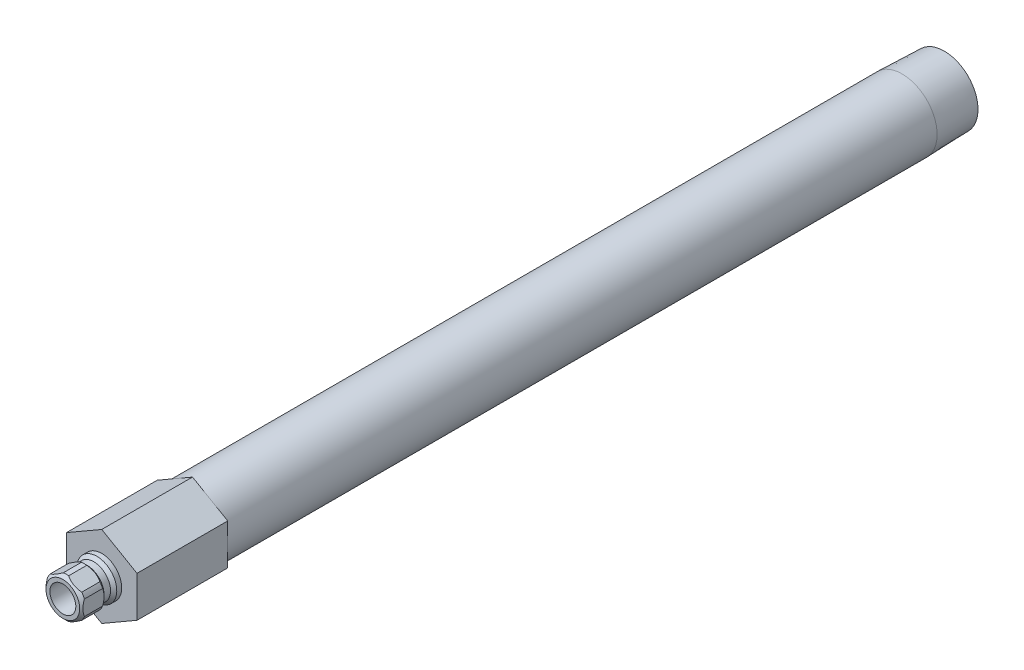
ISO-10303-21;
HEADER;
FILE_DESCRIPTION(('STEP AP214'),'2;1');
FILE_NAME('part.step','',(''),(''),'','','');
FILE_SCHEMA(('AUTOMOTIVE_DESIGN { 1 0 10303 214 1 1 1 1 }'));
ENDSEC;
DATA;
#1=APPLICATION_CONTEXT('core data for automotive mechanical design processes');
#2=APPLICATION_PROTOCOL_DEFINITION('international standard','automotive_design',2000,#1);
#3=PRODUCT_CONTEXT('',#1,'mechanical');
#4=PRODUCT('Part','Part','',(#3));
#5=PRODUCT_RELATED_PRODUCT_CATEGORY('part','',(#4));
#6=PRODUCT_DEFINITION_FORMATION('','',#4);
#7=PRODUCT_DEFINITION_CONTEXT('part definition',#1,'design');
#8=PRODUCT_DEFINITION('design','',#6,#7);
#9=PRODUCT_DEFINITION_SHAPE('','',#8);
#10=(LENGTH_UNIT() NAMED_UNIT(*) SI_UNIT(.MILLI.,.METRE.));
#11=(NAMED_UNIT(*) PLANE_ANGLE_UNIT() SI_UNIT($,.RADIAN.));
#12=(NAMED_UNIT(*) SI_UNIT($,.STERADIAN.) SOLID_ANGLE_UNIT());
#13=UNCERTAINTY_MEASURE_WITH_UNIT(LENGTH_MEASURE(1.E-05),#10,'distance_accuracy_value','');
#14=(GEOMETRIC_REPRESENTATION_CONTEXT(3) GLOBAL_UNCERTAINTY_ASSIGNED_CONTEXT((#13)) GLOBAL_UNIT_ASSIGNED_CONTEXT((#10,
#11,#12)) REPRESENTATION_CONTEXT('',''));
#15=CARTESIAN_POINT('',(0.,0.,0.));
#16=DIRECTION('',(0.,0.,1.));
#17=DIRECTION('',(1.,0.,0.));
#18=AXIS2_PLACEMENT_3D('',#15,#16,#17);
#19=CARTESIAN_POINT('',(0.,0.,0.));
#20=DIRECTION('',(0.,0.,-1.));
#21=DIRECTION('',(0.,1.,0.));
#22=AXIS2_PLACEMENT_3D('',#19,#20,#21);
#23=CYLINDRICAL_SURFACE('',#22,4.8895);
#24=DIRECTION('',(0.,0.,-1.));
#25=VECTOR('',#24,1.);
#26=CARTESIAN_POINT('',(4.5212,1.86170910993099,0.));
#27=LINE('',#26,#25);
#28=CARTESIAN_POINT('',(4.5212,1.86170910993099,4.318));
#29=VERTEX_POINT('',#28);
#30=CARTESIAN_POINT('',(4.5212,1.86170910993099,8.763));
#31=VERTEX_POINT('',#30);
#32=EDGE_CURVE('E404',#29,#31,#27,.F.);
#33=ORIENTED_EDGE('',*,*,#32,.F.);
#34=CARTESIAN_POINT('',(0.,0.,4.318));
#35=DIRECTION('',(0.,0.,-1.));
#36=DIRECTION('',(0.,1.,0.));
#37=AXIS2_PLACEMENT_3D('',#34,#35,#36);
#38=CIRCLE('',#37,4.8895);
#39=CARTESIAN_POINT('',(3.87288738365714,2.98461950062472,4.318));
#40=VERTEX_POINT('',#39);
#41=EDGE_CURVE('E206',#40,#29,#38,.T.);
#42=ORIENTED_EDGE('',*,*,#41,.F.);
#43=DIRECTION('',(0.,0.,-1.));
#44=VECTOR('',#43,1.);
#45=CARTESIAN_POINT('',(3.87288738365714,2.98461950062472,0.));
#46=LINE('',#45,#44);
#47=CARTESIAN_POINT('',(3.87288738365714,2.98461950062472,8.763));
#48=VERTEX_POINT('',#47);
#49=EDGE_CURVE('E392',#48,#40,#46,.T.);
#50=ORIENTED_EDGE('',*,*,#49,.F.);
#51=CARTESIAN_POINT('',(0.,0.,8.763));
#52=DIRECTION('',(0.,0.,-1.));
#53=DIRECTION('',(0.,1.,0.));
#54=AXIS2_PLACEMENT_3D('',#51,#52,#53);
#55=CIRCLE('',#54,4.8895);
#56=EDGE_CURVE('E193',#48,#31,#55,.T.);
#57=ORIENTED_EDGE('',*,*,#56,.T.);
#58=EDGE_LOOP('',(#33,#42,#50,#57));
#59=FACE_BOUND('',#58,.T.);
#60=ADVANCED_FACE('F34',(#59),#23,.T.);
#61=DIRECTION('',(0.,0.,-1.));
#62=VECTOR('',#61,1.);
#63=CARTESIAN_POINT('',(0.648312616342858,4.84632861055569,0.));
#64=LINE('',#63,#62);
#65=CARTESIAN_POINT('',(0.648312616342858,4.84632861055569,4.318));
#66=VERTEX_POINT('',#65);
#67=CARTESIAN_POINT('',(0.648312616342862,4.84632861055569,8.763));
#68=VERTEX_POINT('',#67);
#69=EDGE_CURVE('E311',#66,#68,#64,.F.);
#70=ORIENTED_EDGE('',*,*,#69,.F.);
#71=CARTESIAN_POINT('',(-0.648312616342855,4.84632861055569,4.318));
#72=VERTEX_POINT('',#71);
#73=EDGE_CURVE('E202',#72,#66,#38,.T.);
#74=ORIENTED_EDGE('',*,*,#73,.F.);
#75=DIRECTION('',(0.,0.,-1.));
#76=VECTOR('',#75,1.);
#77=CARTESIAN_POINT('',(-0.648312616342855,4.84632861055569,0.));
#78=LINE('',#77,#76);
#79=CARTESIAN_POINT('',(-0.648312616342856,4.84632861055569,8.763));
#80=VERTEX_POINT('',#79);
#81=EDGE_CURVE('E391',#80,#72,#78,.T.);
#82=ORIENTED_EDGE('',*,*,#81,.F.);
#83=EDGE_CURVE('E196',#80,#68,#55,.T.);
#84=ORIENTED_EDGE('',*,*,#83,.T.);
#85=EDGE_LOOP('',(#70,#74,#82,#84));
#86=FACE_BOUND('',#85,.T.);
#87=ADVANCED_FACE('F345',(#86),#23,.T.);
#88=DIRECTION('',(0.,0.,-1.));
#89=VECTOR('',#88,1.);
#90=CARTESIAN_POINT('',(-3.87288738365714,2.98461950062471,0.));
#91=LINE('',#90,#89);
#92=CARTESIAN_POINT('',(-3.87288738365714,2.98461950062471,4.318));
#93=VERTEX_POINT('',#92);
#94=CARTESIAN_POINT('',(-3.87288738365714,2.98461950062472,8.763));
#95=VERTEX_POINT('',#94);
#96=EDGE_CURVE('E54',#93,#95,#91,.F.);
#97=ORIENTED_EDGE('',*,*,#96,.F.);
#98=CARTESIAN_POINT('',(-4.5212,1.86170910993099,4.318));
#99=VERTEX_POINT('',#98);
#100=EDGE_CURVE('E205',#99,#93,#38,.T.);
#101=ORIENTED_EDGE('',*,*,#100,.F.);
#102=DIRECTION('',(0.,0.,-1.));
#103=VECTOR('',#102,1.);
#104=CARTESIAN_POINT('',(-4.5212,1.86170910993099,0.));
#105=LINE('',#104,#103);
#106=CARTESIAN_POINT('',(-4.5212,1.86170910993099,8.763));
#107=VERTEX_POINT('',#106);
#108=EDGE_CURVE('E378',#107,#99,#105,.T.);
#109=ORIENTED_EDGE('',*,*,#108,.F.);
#110=EDGE_CURVE('E195',#107,#95,#55,.T.);
#111=ORIENTED_EDGE('',*,*,#110,.T.);
#112=EDGE_LOOP('',(#97,#101,#109,#111));
#113=FACE_BOUND('',#112,.T.);
#114=ADVANCED_FACE('F350',(#113),#23,.T.);
#115=DIRECTION('',(0.,0.,-1.));
#116=VECTOR('',#115,1.);
#117=CARTESIAN_POINT('',(-4.5212,-1.86170910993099,0.));
#118=LINE('',#117,#116);
#119=CARTESIAN_POINT('',(-4.5212,-1.86170910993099,4.318));
#120=VERTEX_POINT('',#119);
#121=CARTESIAN_POINT('',(-4.5212,-1.86170910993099,8.763));
#122=VERTEX_POINT('',#121);
#123=EDGE_CURVE('E62',#120,#122,#118,.F.);
#124=ORIENTED_EDGE('',*,*,#123,.F.);
#125=CARTESIAN_POINT('',(-3.87288738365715,-2.98461950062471,4.318));
#126=VERTEX_POINT('',#125);
#127=EDGE_CURVE('E377',#126,#120,#38,.T.);
#128=ORIENTED_EDGE('',*,*,#127,.F.);
#129=DIRECTION('',(0.,0.,-1.));
#130=VECTOR('',#129,1.);
#131=CARTESIAN_POINT('',(-3.87288738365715,-2.98461950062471,0.));
#132=LINE('',#131,#130);
#133=CARTESIAN_POINT('',(-3.87288738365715,-2.98461950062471,8.763));
#134=VERTEX_POINT('',#133);
#135=EDGE_CURVE('E265',#134,#126,#132,.T.);
#136=ORIENTED_EDGE('',*,*,#135,.F.);
#137=EDGE_CURVE('E191',#134,#122,#55,.T.);
#138=ORIENTED_EDGE('',*,*,#137,.T.);
#139=EDGE_LOOP('',(#124,#128,#136,#138));
#140=FACE_BOUND('',#139,.T.);
#141=ADVANCED_FACE('F362',(#140),#23,.T.);
#142=DIRECTION('',(0.,0.,-1.));
#143=VECTOR('',#142,1.);
#144=CARTESIAN_POINT('',(-0.648312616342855,-4.84632861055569,0.));
#145=LINE('',#144,#143);
#146=CARTESIAN_POINT('',(-0.648312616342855,-4.84632861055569,4.318));
#147=VERTEX_POINT('',#146);
#148=CARTESIAN_POINT('',(-0.648312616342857,-4.84632861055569,8.763));
#149=VERTEX_POINT('',#148);
#150=EDGE_CURVE('E394',#147,#149,#145,.F.);
#151=ORIENTED_EDGE('',*,*,#150,.F.);
#152=CARTESIAN_POINT('',(0.648312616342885,-4.84632861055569,4.318));
#153=VERTEX_POINT('',#152);
#154=EDGE_CURVE('E183',#153,#147,#38,.T.);
#155=ORIENTED_EDGE('',*,*,#154,.F.);
#156=DIRECTION('',(0.,0.,-1.));
#157=VECTOR('',#156,1.);
#158=CARTESIAN_POINT('',(0.648312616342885,-4.84632861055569,0.));
#159=LINE('',#158,#157);
#160=CARTESIAN_POINT('',(0.648312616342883,-4.84632861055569,8.763));
#161=VERTEX_POINT('',#160);
#162=EDGE_CURVE('E165',#161,#153,#159,.T.);
#163=ORIENTED_EDGE('',*,*,#162,.F.);
#164=EDGE_CURVE('E181',#161,#149,#55,.T.);
#165=ORIENTED_EDGE('',*,*,#164,.T.);
#166=EDGE_LOOP('',(#151,#155,#163,#165));
#167=FACE_BOUND('',#166,.T.);
#168=ADVANCED_FACE('F180',(#167),#23,.T.);
#169=CARTESIAN_POINT('',(0.,0.,0.));
#170=DIRECTION('',(0.,0.,-1.));
#171=DIRECTION('',(0.,1.,0.));
#172=AXIS2_PLACEMENT_3D('',#169,#170,#171);
#173=CYLINDRICAL_SURFACE('',#172,8.57249999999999);
#174=CARTESIAN_POINT('',(0.,0.,-196.0372));
#175=DIRECTION('',(0.,0.,-1.));
#176=DIRECTION('',(0.,1.,0.));
#177=AXIS2_PLACEMENT_3D('',#174,#175,#176);
#178=CIRCLE('',#177,8.57249999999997);
#179=CARTESIAN_POINT('',(0.,8.5725,-196.0372));
#180=VERTEX_POINT('',#179);
#181=EDGE_CURVE('E219',#180,#180,#178,.T.);
#182=ORIENTED_EDGE('',*,*,#181,.F.);
#183=EDGE_LOOP('',(#182));
#184=FACE_BOUND('',#183,.T.);
#185=CARTESIAN_POINT('',(0.,0.,-22.225));
#186=DIRECTION('',(0.,0.,1.));
#187=DIRECTION('',(1.,0.,0.));
#188=AXIS2_PLACEMENT_3D('',#185,#186,#187);
#189=CIRCLE('',#188,8.57249999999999);
#190=CARTESIAN_POINT('',(8.57249999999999,0.,-22.225));
#191=VERTEX_POINT('',#190);
#192=EDGE_CURVE('E233',#191,#191,#189,.F.);
#193=ORIENTED_EDGE('',*,*,#192,.T.);
#194=EDGE_LOOP('',(#193));
#195=FACE_BOUND('',#194,.T.);
#196=ADVANCED_FACE('F361',(#184,#195),#173,.T.);
#197=CARTESIAN_POINT('',(0.,0.,0.));
#198=DIRECTION('',(0.,0.,-1.));
#199=DIRECTION('',(0.,1.,0.));
#200=AXIS2_PLACEMENT_3D('',#197,#198,#199);
#201=CYLINDRICAL_SURFACE('',#200,3.175);
#202=CARTESIAN_POINT('',(0.,0.,9.525));
#203=DIRECTION('',(0.,0.,-1.));
#204=DIRECTION('',(0.,1.,0.));
#205=AXIS2_PLACEMENT_3D('',#202,#203,#204);
#206=CIRCLE('',#205,3.175);
#207=CARTESIAN_POINT('',(0.,3.175,9.525));
#208=VERTEX_POINT('',#207);
#209=EDGE_CURVE('E235',#208,#208,#206,.T.);
#210=ORIENTED_EDGE('',*,*,#209,.F.);
#211=EDGE_LOOP('',(#210));
#212=FACE_BOUND('',#211,.T.);
#213=CARTESIAN_POINT('',(0.,0.,-22.225));
#214=DIRECTION('',(0.,0.,-1.));
#215=DIRECTION('',(0.,1.,0.));
#216=AXIS2_PLACEMENT_3D('',#213,#214,#215);
#217=CIRCLE('',#216,3.175);
#218=CARTESIAN_POINT('',(0.,3.175,-22.225));
#219=VERTEX_POINT('',#218);
#220=EDGE_CURVE('E174',#219,#219,#217,.T.);
#221=ORIENTED_EDGE('',*,*,#220,.T.);
#222=EDGE_LOOP('',(#221));
#223=FACE_BOUND('',#222,.T.);
#224=ADVANCED_FACE('F36',(#212,#223),#201,.F.);
#225=CARTESIAN_POINT('',(0.,3.175,-22.225));
#226=DIRECTION('',(0.,0.,-1.));
#227=DIRECTION('',(0.,1.,0.));
#228=AXIS2_PLACEMENT_3D('',#225,#226,#227);
#229=PLANE('',#228);
#230=CARTESIAN_POINT('',(0.,0.,-22.225));
#231=DIRECTION('',(0.,0.,-1.));
#232=DIRECTION('',(0.,1.,0.));
#233=AXIS2_PLACEMENT_3D('',#230,#231,#232);
#234=CIRCLE('',#233,6.2611);
#235=CARTESIAN_POINT('',(0.,6.2611,-22.225));
#236=VERTEX_POINT('',#235);
#237=EDGE_CURVE('E228',#236,#236,#234,.T.);
#238=ORIENTED_EDGE('',*,*,#237,.T.);
#239=EDGE_LOOP('',(#238));
#240=FACE_BOUND('',#239,.T.);
#241=ORIENTED_EDGE('',*,*,#220,.F.);
#242=EDGE_LOOP('',(#241));
#243=FACE_BOUND('',#242,.T.);
#244=ADVANCED_FACE('F533',(#240,#243),#229,.T.);
#245=CARTESIAN_POINT('',(0.,0.,0.));
#246=DIRECTION('',(0.,0.,-1.));
#247=DIRECTION('',(0.,1.,0.));
#248=AXIS2_PLACEMENT_3D('',#245,#246,#247);
#249=CYLINDRICAL_SURFACE('',#248,6.26109999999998);
#250=CARTESIAN_POINT('',(0.,0.,-206.375));
#251=DIRECTION('',(0.,0.,-1.));
#252=DIRECTION('',(0.,1.,0.));
#253=AXIS2_PLACEMENT_3D('',#250,#251,#252);
#254=CIRCLE('',#253,6.26109999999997);
#255=CARTESIAN_POINT('',(0.,6.2611,-206.375));
#256=VERTEX_POINT('',#255);
#257=EDGE_CURVE('E225',#256,#256,#254,.T.);
#258=ORIENTED_EDGE('',*,*,#257,.T.);
#259=EDGE_LOOP('',(#258));
#260=FACE_BOUND('',#259,.T.);
#261=ORIENTED_EDGE('',*,*,#237,.F.);
#262=EDGE_LOOP('',(#261));
#263=FACE_BOUND('',#262,.T.);
#264=ADVANCED_FACE('F530',(#260,#263),#249,.F.);
#265=CARTESIAN_POINT('',(0.,8.24944566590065,-206.375));
#266=DIRECTION('',(0.,0.,-1.));
#267=DIRECTION('',(0.,1.,0.));
#268=AXIS2_PLACEMENT_3D('',#265,#266,#267);
#269=PLANE('',#268);
#270=CARTESIAN_POINT('',(0.,0.,-206.375));
#271=DIRECTION('',(0.,0.,-1.));
#272=DIRECTION('',(0.,1.,0.));
#273=AXIS2_PLACEMENT_3D('',#270,#271,#272);
#274=CIRCLE('',#273,8.24944566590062);
#275=CARTESIAN_POINT('',(0.,8.24944566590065,-206.375));
#276=VERTEX_POINT('',#275);
#277=EDGE_CURVE('E222',#276,#276,#274,.T.);
#278=ORIENTED_EDGE('',*,*,#277,.T.);
#279=EDGE_LOOP('',(#278));
#280=FACE_BOUND('',#279,.T.);
#281=ORIENTED_EDGE('',*,*,#257,.F.);
#282=EDGE_LOOP('',(#281));
#283=FACE_BOUND('',#282,.T.);
#284=ADVANCED_FACE('F524',(#280,#283),#269,.T.);
#285=CARTESIAN_POINT('',(0.,0.,-206.375));
#286=DIRECTION('',(0.,0.,1.));
#287=DIRECTION('',(0.,-1.,0.));
#288=AXIS2_PLACEMENT_3D('',#285,#286,#287);
#289=CONICAL_SURFACE('',#288,8.24944566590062,0.0312396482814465);
#290=ORIENTED_EDGE('',*,*,#181,.T.);
#291=EDGE_LOOP('',(#290));
#292=FACE_BOUND('',#291,.T.);
#293=ORIENTED_EDGE('',*,*,#277,.F.);
#294=EDGE_LOOP('',(#293));
#295=FACE_BOUND('',#294,.T.);
#296=ADVANCED_FACE('F514',(#292,#295),#289,.T.);
#297=CARTESIAN_POINT('',(0.,4.8895,0.));
#298=DIRECTION('',(0.,0.,1.));
#299=DIRECTION('',(0.,-1.,0.));
#300=AXIS2_PLACEMENT_3D('',#297,#298,#299);
#301=PLANE('',#300);
#302=CARTESIAN_POINT('',(0.,0.,0.));
#303=DIRECTION('',(0.,0.,-1.));
#304=DIRECTION('',(0.,1.,0.));
#305=AXIS2_PLACEMENT_3D('',#302,#303,#304);
#306=CIRCLE('',#305,4.8895);
#307=CARTESIAN_POINT('',(0.,4.8895,0.));
#308=VERTEX_POINT('',#307);
#309=EDGE_CURVE('E216',#308,#308,#306,.T.);
#310=ORIENTED_EDGE('',*,*,#309,.T.);
#311=EDGE_LOOP('',(#310));
#312=FACE_BOUND('',#311,.T.);
#313=DIRECTION('',(-0.866025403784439,-0.5,0.));
#314=VECTOR('',#313,1.);
#315=CARTESIAN_POINT('',(0.,9.97199384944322,0.));
#316=LINE('',#315,#314);
#317=CARTESIAN_POINT('',(0.,9.97199384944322,0.));
#318=VERTEX_POINT('',#317);
#319=CARTESIAN_POINT('',(-8.636,4.98599692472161,0.));
#320=VERTEX_POINT('',#319);
#321=EDGE_CURVE('E409',#318,#320,#316,.T.);
#322=ORIENTED_EDGE('',*,*,#321,.T.);
#323=DIRECTION('',(0.,-1.,0.));
#324=VECTOR('',#323,1.);
#325=CARTESIAN_POINT('',(-8.636,4.98599692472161,0.));
#326=LINE('',#325,#324);
#327=CARTESIAN_POINT('',(-8.636,-4.98599692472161,0.));
#328=VERTEX_POINT('',#327);
#329=EDGE_CURVE('E436',#320,#328,#326,.T.);
#330=ORIENTED_EDGE('',*,*,#329,.T.);
#331=DIRECTION('',(0.866025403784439,-0.5,0.));
#332=VECTOR('',#331,1.);
#333=CARTESIAN_POINT('',(-8.636,-4.98599692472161,0.));
#334=LINE('',#333,#332);
#335=CARTESIAN_POINT('',(0.,-9.97199384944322,0.));
#336=VERTEX_POINT('',#335);
#337=EDGE_CURVE('E439',#328,#336,#334,.T.);
#338=ORIENTED_EDGE('',*,*,#337,.T.);
#339=DIRECTION('',(0.866025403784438,0.5,0.));
#340=VECTOR('',#339,1.);
#341=CARTESIAN_POINT('',(0.,-9.97199384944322,0.));
#342=LINE('',#341,#340);
#343=CARTESIAN_POINT('',(8.636,-4.98599692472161,0.));
#344=VERTEX_POINT('',#343);
#345=EDGE_CURVE('E442',#336,#344,#342,.T.);
#346=ORIENTED_EDGE('',*,*,#345,.T.);
#347=DIRECTION('',(0.,1.,0.));
#348=VECTOR('',#347,1.);
#349=CARTESIAN_POINT('',(8.636,-4.98599692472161,0.));
#350=LINE('',#349,#348);
#351=CARTESIAN_POINT('',(8.636,4.98599692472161,0.));
#352=VERTEX_POINT('',#351);
#353=EDGE_CURVE('E445',#344,#352,#350,.T.);
#354=ORIENTED_EDGE('',*,*,#353,.T.);
#355=DIRECTION('',(-0.866025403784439,0.5,0.));
#356=VECTOR('',#355,1.);
#357=CARTESIAN_POINT('',(8.636,4.98599692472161,0.));
#358=LINE('',#357,#356);
#359=EDGE_CURVE('E418',#352,#318,#358,.T.);
#360=ORIENTED_EDGE('',*,*,#359,.T.);
#361=EDGE_LOOP('',(#322,#330,#338,#346,#354,#360));
#362=FACE_BOUND('',#361,.T.);
#363=ADVANCED_FACE('F511',(#312,#362),#301,.T.);
#364=CARTESIAN_POINT('',(0.,0.,0.));
#365=DIRECTION('',(0.,0.,-1.));
#366=DIRECTION('',(0.,1.,0.));
#367=AXIS2_PLACEMENT_3D('',#364,#365,#366);
#368=CYLINDRICAL_SURFACE('',#367,4.8895);
#369=CARTESIAN_POINT('',(0.,0.,1.2065));
#370=DIRECTION('',(0.,0.,-1.));
#371=DIRECTION('',(0.,1.,0.));
#372=AXIS2_PLACEMENT_3D('',#369,#370,#371);
#373=CIRCLE('',#372,4.8895);
#374=CARTESIAN_POINT('',(0.,4.8895,1.2065));
#375=VERTEX_POINT('',#374);
#376=EDGE_CURVE('E213',#375,#375,#373,.T.);
#377=ORIENTED_EDGE('',*,*,#376,.T.);
#378=EDGE_LOOP('',(#377));
#379=FACE_BOUND('',#378,.T.);
#380=ORIENTED_EDGE('',*,*,#309,.F.);
#381=EDGE_LOOP('',(#380));
#382=FACE_BOUND('',#381,.T.);
#383=ADVANCED_FACE('F513',(#379,#382),#368,.T.);
#384=CARTESIAN_POINT('',(0.,0.,1.2065));
#385=DIRECTION('',(0.,0.,-1.));
#386=DIRECTION('',(0.,1.,0.));
#387=AXIS2_PLACEMENT_3D('',#384,#385,#386);
#388=CONICAL_SURFACE('',#387,4.8895,0.785398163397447);
#389=CARTESIAN_POINT('',(0.,0.,1.9685));
#390=DIRECTION('',(0.,0.,-1.));
#391=DIRECTION('',(0.,1.,0.));
#392=AXIS2_PLACEMENT_3D('',#389,#390,#391);
#393=CIRCLE('',#392,4.1275);
#394=CARTESIAN_POINT('',(0.,4.1275,1.9685));
#395=VERTEX_POINT('',#394);
#396=EDGE_CURVE('E210',#395,#395,#393,.T.);
#397=ORIENTED_EDGE('',*,*,#396,.T.);
#398=EDGE_LOOP('',(#397));
#399=FACE_BOUND('',#398,.T.);
#400=ORIENTED_EDGE('',*,*,#376,.F.);
#401=EDGE_LOOP('',(#400));
#402=FACE_BOUND('',#401,.T.);
#403=ADVANCED_FACE('F521',(#399,#402),#388,.T.);
#404=CARTESIAN_POINT('',(0.,0.,0.));
#405=DIRECTION('',(0.,0.,-1.));
#406=DIRECTION('',(0.,1.,0.));
#407=AXIS2_PLACEMENT_3D('',#404,#405,#406);
#408=CYLINDRICAL_SURFACE('',#407,4.1275);
#409=CARTESIAN_POINT('',(0.,0.,3.556));
#410=DIRECTION('',(0.,0.,-1.));
#411=DIRECTION('',(0.,1.,0.));
#412=AXIS2_PLACEMENT_3D('',#409,#410,#411);
#413=CIRCLE('',#412,4.1275);
#414=CARTESIAN_POINT('',(0.,4.1275,3.556));
#415=VERTEX_POINT('',#414);
#416=EDGE_CURVE('E207',#415,#415,#413,.T.);
#417=ORIENTED_EDGE('',*,*,#416,.T.);
#418=EDGE_LOOP('',(#417));
#419=FACE_BOUND('',#418,.T.);
#420=ORIENTED_EDGE('',*,*,#396,.F.);
#421=EDGE_LOOP('',(#420));
#422=FACE_BOUND('',#421,.T.);
#423=ADVANCED_FACE('F272',(#419,#422),#408,.T.);
#424=CARTESIAN_POINT('',(0.,0.,3.556));
#425=DIRECTION('',(0.,0.,1.));
#426=DIRECTION('',(0.,-1.,0.));
#427=AXIS2_PLACEMENT_3D('',#424,#425,#426);
#428=CONICAL_SURFACE('',#427,4.1275,0.785398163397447);
#429=CARTESIAN_POINT('',(4.52119999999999,-5.15925306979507,6.28846659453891));
#430=CARTESIAN_POINT('',(4.52119999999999,-5.03341781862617,6.19384981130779));
#431=CARTESIAN_POINT('',(4.52119999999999,-4.90687282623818,6.100161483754));
#432=CARTESIAN_POINT('',(4.52119999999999,-4.65208542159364,5.91505573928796));
#433=CARTESIAN_POINT('',(4.52119999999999,-4.52384258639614,5.8236389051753));
#434=CARTESIAN_POINT('',(4.52119999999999,-4.26444371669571,5.64284060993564));
#435=CARTESIAN_POINT('',(4.52119999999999,-4.1332728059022,5.5534804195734));
#436=CARTESIAN_POINT('',(4.52119999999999,-3.86869655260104,5.37814219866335));
#437=CARTESIAN_POINT('',(4.52119999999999,-3.73529136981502,5.29216392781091));
#438=CARTESIAN_POINT('',(4.52119999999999,-3.45835736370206,5.11964219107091));
#439=CARTESIAN_POINT('',(4.52119999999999,-3.31467977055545,5.03333631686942));
#440=CARTESIAN_POINT('',(4.52119999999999,-3.02397608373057,4.86646929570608));
#441=CARTESIAN_POINT('',(4.52119999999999,-2.87694947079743,4.78590904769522));
#442=CARTESIAN_POINT('',(4.52119999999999,-2.57957206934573,4.6322757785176));
#443=CARTESIAN_POINT('',(4.52119999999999,-2.42923274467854,4.55918074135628));
#444=CARTESIAN_POINT('',(4.52119999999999,-2.12448469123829,4.4221138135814));
#445=CARTESIAN_POINT('',(4.52119999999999,-1.97007782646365,4.35813782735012));
#446=CARTESIAN_POINT('',(4.52119999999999,-1.66898205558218,4.24604782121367));
#447=CARTESIAN_POINT('',(4.52119999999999,-1.52260919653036,4.19709368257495));
#448=CARTESIAN_POINT('',(4.52119999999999,-1.22638031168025,4.11093488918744));
#449=CARTESIAN_POINT('',(4.52119999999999,-1.07652404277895,4.07373105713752));
#450=CARTESIAN_POINT('',(4.52119999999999,-0.776693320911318,4.01362130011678));
#451=CARTESIAN_POINT('',(4.52119999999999,-0.626768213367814,3.99047322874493));
#452=CARTESIAN_POINT('',(4.52119999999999,-0.325366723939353,3.95891692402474));
#453=CARTESIAN_POINT('',(4.52119999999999,-0.173890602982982,3.95050625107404));
#454=CARTESIAN_POINT('',(4.52119999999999,0.123852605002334,3.94903068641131));
#455=CARTESIAN_POINT('',(4.52119999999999,0.270117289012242,3.95544130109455));
#456=CARTESIAN_POINT('',(4.52119999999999,0.561370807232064,3.98210770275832));
#457=CARTESIAN_POINT('',(4.5212,0.706359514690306,4.0023648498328));
#458=CARTESIAN_POINT('',(4.5212,0.996462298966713,4.05597163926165));
#459=CARTESIAN_POINT('',(4.5212,1.14153485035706,4.08954247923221));
#460=CARTESIAN_POINT('',(4.5212,1.42852462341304,4.1680002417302));
#461=CARTESIAN_POINT('',(4.5212,1.57044212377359,4.21288616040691));
#462=CARTESIAN_POINT('',(4.5212,1.86505501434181,4.31714129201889));
#463=CARTESIAN_POINT('',(4.5212,2.01739126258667,4.377515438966));
#464=CARTESIAN_POINT('',(4.5212,2.31809735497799,4.50751823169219));
#465=CARTESIAN_POINT('',(4.5212,2.46646529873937,4.57715121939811));
#466=CARTESIAN_POINT('',(4.5212,2.75996557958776,4.72401353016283));
#467=CARTESIAN_POINT('',(4.5212,2.9050858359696,4.80126680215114));
#468=CARTESIAN_POINT('',(4.5212,3.19198335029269,4.96166050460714));
#469=CARTESIAN_POINT('',(4.5212,3.33376113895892,5.04479999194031));
#470=CARTESIAN_POINT('',(4.5212,3.60742153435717,5.21154136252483));
#471=CARTESIAN_POINT('',(4.5212,3.73944496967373,5.29491333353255));
#472=CARTESIAN_POINT('',(4.5212,4.00122581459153,5.46515273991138));
#473=CARTESIAN_POINT('',(4.5212,4.13098305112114,5.55202044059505));
#474=CARTESIAN_POINT('',(4.5212,4.38747396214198,5.72790624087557));
#475=CARTESIAN_POINT('',(4.5212,4.51422365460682,5.81690106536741));
#476=CARTESIAN_POINT('',(4.5212,4.76599253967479,5.99723636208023));
#477=CARTESIAN_POINT('',(4.5212,4.89101219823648,6.08857618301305));
#478=CARTESIAN_POINT('',(4.5212,5.0153077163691,6.18087446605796));
#479=B_SPLINE_CURVE_WITH_KNOTS('',3,(#429,#430,#431,#432,#433,#434,#435,#436,#437,#438,#439,
#440,#441,#442,#443,#444,#445,#446,#447,#448,#449,#450,#451,#452,#453,#454,#455,#456,#457,#458,
#459,#460,#461,#462,#463,#464,#465,#466,#467,#468,#469,#470,#471,#472,#473,#474,#475,#476,#477,
#478),.UNSPECIFIED.,.F.,.F.,(4,2,2,2,2,2,2,2,2,2,2,2,2,2,2,2,2,2,2,2,2,2,2,2,4),(0.,
0.472324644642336,0.944769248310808,1.42087610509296,1.89694907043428,2.39966187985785,
2.90245317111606,3.40371602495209,3.90475303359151,4.36737130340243,4.83002195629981,
5.28445770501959,5.73881822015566,6.17734710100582,6.61591906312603,7.06210522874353,
7.5082518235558,7.99945943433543,8.49089821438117,8.98393391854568,9.4768908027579,
9.94525924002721,10.4136632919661,10.8782525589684,11.3427141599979),.UNSPECIFIED.);
#480=CARTESIAN_POINT('',(4.52119999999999,-1.861709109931,4.318));
#481=VERTEX_POINT('',#480);
#482=EDGE_CURVE('E407',#481,#29,#479,.T.);
#483=ORIENTED_EDGE('',*,*,#482,.F.);
#484=CARTESIAN_POINT('',(3.87288738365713,-2.98461950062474,4.318));
#485=VERTEX_POINT('',#484);
#486=EDGE_CURVE('E385',#481,#485,#38,.T.);
#487=ORIENTED_EDGE('',*,*,#486,.T.);
#488=CARTESIAN_POINT('',(0.647857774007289,-4.84659121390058,4.3182));
#489=CARTESIAN_POINT('',(0.775261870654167,-4.77303442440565,4.26213711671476));
#490=CARTESIAN_POINT('',(0.904457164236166,-4.69844348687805,4.21102627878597));
#491=CARTESIAN_POINT('',(1.16629518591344,-4.5472712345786,4.1207431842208));
#492=CARTESIAN_POINT('',(1.29894624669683,-4.47068510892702,4.08160338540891));
#493=CARTESIAN_POINT('',(1.56203676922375,-4.31878972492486,4.01877592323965));
#494=CARTESIAN_POINT('',(1.69238331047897,-4.24353411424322,3.99458163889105));
#495=CARTESIAN_POINT('',(1.95434729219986,-4.09228913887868,3.96102228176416));
#496=CARTESIAN_POINT('',(2.08596281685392,-4.01630088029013,3.95163757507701));
#497=CARTESIAN_POINT('',(2.3562305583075,-3.86026172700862,3.94821923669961));
#498=CARTESIAN_POINT('',(2.49489129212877,-3.78020591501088,3.95501290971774));
#499=CARTESIAN_POINT('',(2.7710334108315,-3.62077518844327,3.9851849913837));
#500=CARTESIAN_POINT('',(2.90851272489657,-3.5414014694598,4.00858815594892));
#501=CARTESIAN_POINT('',(3.18622016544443,-3.38106700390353,4.07155129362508));
#502=CARTESIAN_POINT('',(3.32634361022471,-3.30016669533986,4.11171074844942));
#503=CARTESIAN_POINT('',(3.60275664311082,-3.14057955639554,4.20550294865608));
#504=CARTESIAN_POINT('',(3.73905611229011,-3.06188702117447,4.25909654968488));
#505=CARTESIAN_POINT('',(3.87334222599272,-2.98435689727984,4.3182));
#506=B_SPLINE_CURVE_WITH_KNOTS('',3,(#488,#489,#490,#491,#492,#493,#494,#495,#496,#497,#498,
#499,#500,#501,#502,#503,#504,#505),.UNSPECIFIED.,.F.,.F.,(4,2,2,2,2,2,2,2,4),(0.,
0.472469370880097,0.946208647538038,1.40285320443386,1.85889185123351,2.33874707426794,
2.81931901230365,3.31879975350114,3.81684169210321),.UNSPECIFIED.);
#507=EDGE_CURVE('E258',#153,#485,#506,.T.);
#508=ORIENTED_EDGE('',*,*,#507,.F.);
#509=ORIENTED_EDGE('',*,*,#154,.T.);
#510=CARTESIAN_POINT('',(-3.87334222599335,-2.98435689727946,4.31820000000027));
#511=CARTESIAN_POINT('',(-3.74593812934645,-3.05791368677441,4.262137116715));
#512=CARTESIAN_POINT('',(-3.61674283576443,-3.13250462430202,4.21102627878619));
#513=CARTESIAN_POINT('',(-3.35490481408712,-3.2836768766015,4.12074318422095));
#514=CARTESIAN_POINT('',(-3.2222537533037,-3.36026300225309,4.08160338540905));
#515=CARTESIAN_POINT('',(-2.95916323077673,-3.51215838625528,4.01877592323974));
#516=CARTESIAN_POINT('',(-2.82881668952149,-3.58741399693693,3.99458163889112));
#517=CARTESIAN_POINT('',(-2.56685270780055,-3.73865897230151,3.96102228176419));
#518=CARTESIAN_POINT('',(-2.43523718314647,-3.81464723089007,3.95163757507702));
#519=CARTESIAN_POINT('',(-2.16496944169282,-3.97068638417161,3.94821923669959));
#520=CARTESIAN_POINT('',(-2.02630870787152,-4.05074219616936,3.9550129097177));
#521=CARTESIAN_POINT('',(-1.75016658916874,-4.21017292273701,3.98518499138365));
#522=CARTESIAN_POINT('',(-1.61268727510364,-4.2895466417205,4.00858815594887));
#523=CARTESIAN_POINT('',(-1.33497983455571,-4.44988110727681,4.07155129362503));
#524=CARTESIAN_POINT('',(-1.1948563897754,-4.5307814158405,4.11171074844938));
#525=CARTESIAN_POINT('',(-0.918443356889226,-4.69036855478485,4.20550294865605));
#526=CARTESIAN_POINT('',(-0.782143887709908,-4.76906109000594,4.25909654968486));
#527=CARTESIAN_POINT('',(-0.647857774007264,-4.84659121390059,4.3182));
#528=B_SPLINE_CURVE_WITH_KNOTS('',3,(#510,#511,#512,#513,#514,#515,#516,#517,#518,#519,#520,
#521,#522,#523,#524,#525,#526,#527),.UNSPECIFIED.,.F.,.F.,(4,2,2,2,2,2,2,2,4),(0.,
0.472469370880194,0.946208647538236,1.40285320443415,1.85889185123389,2.33874707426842,
2.81931901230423,3.31879975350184,3.81684169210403),.UNSPECIFIED.);
#529=EDGE_CURVE('E281',#126,#147,#528,.T.);
#530=ORIENTED_EDGE('',*,*,#529,.F.);
#531=ORIENTED_EDGE('',*,*,#127,.T.);
#532=CARTESIAN_POINT('',(-4.5212,-5.15925306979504,6.2884665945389));
#533=CARTESIAN_POINT('',(-4.5212,-5.03341781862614,6.19384981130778));
#534=CARTESIAN_POINT('',(-4.5212,-4.90687282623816,6.10016148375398));
#535=CARTESIAN_POINT('',(-4.5212,-4.65208542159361,5.91505573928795));
#536=CARTESIAN_POINT('',(-4.5212,-4.52384258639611,5.82363890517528));
#537=CARTESIAN_POINT('',(-4.5212,-4.26444371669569,5.64284060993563));
#538=CARTESIAN_POINT('',(-4.5212,-4.13327280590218,5.55348041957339));
#539=CARTESIAN_POINT('',(-4.5212,-3.86869655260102,5.37814219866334));
#540=CARTESIAN_POINT('',(-4.5212,-3.735291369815,5.2921639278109));
#541=CARTESIAN_POINT('',(-4.5212,-3.45835736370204,5.1196421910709));
#542=CARTESIAN_POINT('',(-4.5212,-3.31467977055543,5.03333631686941));
#543=CARTESIAN_POINT('',(-4.5212,-3.02397608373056,4.86646929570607));
#544=CARTESIAN_POINT('',(-4.5212,-2.87694947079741,4.78590904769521));
#545=CARTESIAN_POINT('',(-4.5212,-2.57957206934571,4.63227577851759));
#546=CARTESIAN_POINT('',(-4.5212,-2.42923274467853,4.55918074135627));
#547=CARTESIAN_POINT('',(-4.5212,-2.12448469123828,4.4221138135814));
#548=CARTESIAN_POINT('',(-4.5212,-1.97007782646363,4.35813782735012));
#549=CARTESIAN_POINT('',(-4.5212,-1.66898205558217,4.24604782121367));
#550=CARTESIAN_POINT('',(-4.5212,-1.52260919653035,4.19709368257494));
#551=CARTESIAN_POINT('',(-4.5212,-1.22638031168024,4.11093488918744));
#552=CARTESIAN_POINT('',(-4.5212,-1.07652404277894,4.07373105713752));
#553=CARTESIAN_POINT('',(-4.5212,-0.776693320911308,4.01362130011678));
#554=CARTESIAN_POINT('',(-4.5212,-0.626768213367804,3.99047322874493));
#555=CARTESIAN_POINT('',(-4.5212,-0.325366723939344,3.95891692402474));
#556=CARTESIAN_POINT('',(-4.5212,-0.173890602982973,3.95050625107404));
#557=CARTESIAN_POINT('',(-4.5212,0.123852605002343,3.94903068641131));
#558=CARTESIAN_POINT('',(-4.5212,0.270117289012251,3.95544130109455));
#559=CARTESIAN_POINT('',(-4.5212,0.561370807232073,3.98210770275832));
#560=CARTESIAN_POINT('',(-4.5212,0.706359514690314,4.0023648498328));
#561=CARTESIAN_POINT('',(-4.5212,0.996462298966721,4.05597163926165));
#562=CARTESIAN_POINT('',(-4.5212,1.14153485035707,4.08954247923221));
#563=CARTESIAN_POINT('',(-4.5212,1.42852462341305,4.16800024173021));
#564=CARTESIAN_POINT('',(-4.5212,1.5704421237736,4.21288616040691));
#565=CARTESIAN_POINT('',(-4.5212,1.86505501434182,4.31714129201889));
#566=CARTESIAN_POINT('',(-4.5212,2.01739126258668,4.377515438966));
#567=CARTESIAN_POINT('',(-4.5212,2.318097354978,4.50751823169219));
#568=CARTESIAN_POINT('',(-4.5212,2.46646529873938,4.57715121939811));
#569=CARTESIAN_POINT('',(-4.5212,2.75996557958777,4.72401353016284));
#570=CARTESIAN_POINT('',(-4.5212,2.9050858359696,4.80126680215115));
#571=CARTESIAN_POINT('',(-4.5212,3.1919833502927,4.96166050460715));
#572=CARTESIAN_POINT('',(-4.5212,3.33376113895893,5.04479999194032));
#573=CARTESIAN_POINT('',(-4.5212,3.60742153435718,5.21154136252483));
#574=CARTESIAN_POINT('',(-4.5212,3.73944496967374,5.29491333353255));
#575=CARTESIAN_POINT('',(-4.5212,4.00122581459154,5.46515273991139));
#576=CARTESIAN_POINT('',(-4.5212,4.13098305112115,5.55202044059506));
#577=CARTESIAN_POINT('',(-4.5212,4.38747396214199,5.72790624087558));
#578=CARTESIAN_POINT('',(-4.5212,4.51422365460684,5.81690106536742));
#579=CARTESIAN_POINT('',(-4.5212,4.76599253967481,5.99723636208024));
#580=CARTESIAN_POINT('',(-4.5212,4.89101219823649,6.08857618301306));
#581=CARTESIAN_POINT('',(-4.5212,5.01530771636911,6.18087446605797));
#582=B_SPLINE_CURVE_WITH_KNOTS('',3,(#532,#533,#534,#535,#536,#537,#538,#539,#540,#541,#542,
#543,#544,#545,#546,#547,#548,#549,#550,#551,#552,#553,#554,#555,#556,#557,#558,#559,#560,#561,
#562,#563,#564,#565,#566,#567,#568,#569,#570,#571,#572,#573,#574,#575,#576,#577,#578,#579,#580,
#581),.UNSPECIFIED.,.F.,.F.,(4,2,2,2,2,2,2,2,2,2,2,2,2,2,2,2,2,2,2,2,2,2,2,2,4),(0.,
0.472324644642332,0.944769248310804,1.42087610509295,1.89694907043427,2.39966187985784,
2.90245317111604,3.40371602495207,3.90475303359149,4.36737130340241,4.83002195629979,
5.28445770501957,5.73881822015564,6.1773471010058,6.615919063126,7.06210522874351,
7.50825182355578,7.9994594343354,8.49089821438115,8.98393391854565,9.47689080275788,
9.94525924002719,10.4136632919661,10.8782525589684,11.3427141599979),.UNSPECIFIED.);
#583=EDGE_CURVE('E288',#99,#120,#582,.F.);
#584=ORIENTED_EDGE('',*,*,#583,.F.);
#585=ORIENTED_EDGE('',*,*,#100,.T.);
#586=CARTESIAN_POINT('',(-0.647857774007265,4.84659121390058,4.3182));
#587=CARTESIAN_POINT('',(-0.775261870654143,4.77303442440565,4.26213711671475));
#588=CARTESIAN_POINT('',(-0.904457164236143,4.69844348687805,4.21102627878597));
#589=CARTESIAN_POINT('',(-1.16629518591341,4.5472712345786,4.12074318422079));
#590=CARTESIAN_POINT('',(-1.2989462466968,4.47068510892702,4.08160338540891));
#591=CARTESIAN_POINT('',(-1.56203676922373,4.31878972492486,4.01877592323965));
#592=CARTESIAN_POINT('',(-1.69238331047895,4.24353411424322,3.99458163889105));
#593=CARTESIAN_POINT('',(-1.95434729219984,4.09228913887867,3.96102228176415));
#594=CARTESIAN_POINT('',(-2.0859628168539,4.01630088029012,3.95163757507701));
#595=CARTESIAN_POINT('',(-2.35623055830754,3.86026172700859,3.9482192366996));
#596=CARTESIAN_POINT('',(-2.49489129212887,3.78020591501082,3.95501290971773));
#597=CARTESIAN_POINT('',(-2.7710334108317,3.62077518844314,3.98518499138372));
#598=CARTESIAN_POINT('',(-2.90851272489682,3.54140146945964,4.00858815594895));
#599=CARTESIAN_POINT('',(-3.18622016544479,3.38106700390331,4.07155129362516));
#600=CARTESIAN_POINT('',(-3.32634361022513,3.3001666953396,4.11171074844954));
#601=CARTESIAN_POINT('',(-3.60275664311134,3.14057955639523,4.20550294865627));
#602=CARTESIAN_POINT('',(-3.73905611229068,3.06188702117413,4.2590965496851));
#603=CARTESIAN_POINT('',(-3.87334222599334,2.98435689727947,4.31820000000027));
#604=B_SPLINE_CURVE_WITH_KNOTS('',3,(#586,#587,#588,#589,#590,#591,#592,#593,#594,#595,#596,
#597,#598,#599,#600,#601,#602,#603),.UNSPECIFIED.,.F.,.F.,(4,2,2,2,2,2,2,2,4),(0.,
0.472469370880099,0.946208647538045,1.40285320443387,1.85889185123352,2.33874707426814,
2.81931901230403,3.31879975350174,3.81684169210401),.UNSPECIFIED.);
#605=EDGE_CURVE('E295',#72,#93,#604,.T.);
#606=ORIENTED_EDGE('',*,*,#605,.F.);
#607=ORIENTED_EDGE('',*,*,#73,.T.);
#608=CARTESIAN_POINT('',(3.87334222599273,2.98435689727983,4.3182));
#609=CARTESIAN_POINT('',(3.74593812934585,3.05791368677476,4.26213711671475));
#610=CARTESIAN_POINT('',(3.61674283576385,3.13250462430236,4.21102627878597));
#611=CARTESIAN_POINT('',(3.35490481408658,3.28367687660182,4.12074318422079));
#612=CARTESIAN_POINT('',(3.22225375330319,3.3602630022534,4.08160338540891));
#613=CARTESIAN_POINT('',(2.95916323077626,3.51215838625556,4.01877592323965));
#614=CARTESIAN_POINT('',(2.82881668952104,3.58741399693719,3.99458163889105));
#615=CARTESIAN_POINT('',(2.56685270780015,3.73865897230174,3.96102228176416));
#616=CARTESIAN_POINT('',(2.4352371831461,3.81464723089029,3.95163757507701));
#617=CARTESIAN_POINT('',(2.16496944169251,3.97068638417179,3.94821923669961));
#618=CARTESIAN_POINT('',(2.02630870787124,4.05074219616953,3.95501290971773));
#619=CARTESIAN_POINT('',(1.75016658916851,4.21017292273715,3.98518499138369));
#620=CARTESIAN_POINT('',(1.61268727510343,4.28954664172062,4.00858815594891));
#621=CARTESIAN_POINT('',(1.33497983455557,4.44988110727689,4.07155129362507));
#622=CARTESIAN_POINT('',(1.19485638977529,4.53078141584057,4.11171074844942));
#623=CARTESIAN_POINT('',(0.918443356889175,4.69036855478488,4.20550294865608));
#624=CARTESIAN_POINT('',(0.782143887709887,4.76906109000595,4.25909654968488));
#625=CARTESIAN_POINT('',(0.64785777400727,4.84659121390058,4.3182));
#626=B_SPLINE_CURVE_WITH_KNOTS('',3,(#608,#609,#610,#611,#612,#613,#614,#615,#616,#617,#618,
#619,#620,#621,#622,#623,#624,#625),.UNSPECIFIED.,.F.,.F.,(4,2,2,2,2,2,2,2,4),(0.,
0.472469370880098,0.946208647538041,1.40285320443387,1.85889185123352,2.33874707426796,
2.81931901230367,3.31879975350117,3.81684169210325),.UNSPECIFIED.);
#627=EDGE_CURVE('E303',#40,#66,#626,.T.);
#628=ORIENTED_EDGE('',*,*,#627,.F.);
#629=ORIENTED_EDGE('',*,*,#41,.T.);
#630=EDGE_LOOP('',(#483,#487,#508,#509,#530,#531,#584,#585,#606,#607,#628,#629));
#631=FACE_BOUND('',#630,.T.);
#632=ORIENTED_EDGE('',*,*,#416,.F.);
#633=EDGE_LOOP('',(#632));
#634=FACE_BOUND('',#633,.T.);
#635=ADVANCED_FACE('F267',(#631,#634),#428,.T.);
#636=DIRECTION('',(0.,0.,-1.));
#637=VECTOR('',#636,1.);
#638=CARTESIAN_POINT('',(4.52119999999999,-1.861709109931,0.));
#639=LINE('',#638,#637);
#640=CARTESIAN_POINT('',(4.52119999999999,-1.861709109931,8.763));
#641=VERTEX_POINT('',#640);
#642=EDGE_CURVE('E310',#641,#481,#639,.T.);
#643=ORIENTED_EDGE('',*,*,#642,.F.);
#644=CARTESIAN_POINT('',(3.87288738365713,-2.98461950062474,8.763));
#645=VERTEX_POINT('',#644);
#646=EDGE_CURVE('E190',#641,#645,#55,.T.);
#647=ORIENTED_EDGE('',*,*,#646,.T.);
#648=DIRECTION('',(0.,0.,-1.));
#649=VECTOR('',#648,1.);
#650=CARTESIAN_POINT('',(3.87288738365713,-2.98461950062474,0.));
#651=LINE('',#650,#649);
#652=EDGE_CURVE('E168',#485,#645,#651,.F.);
#653=ORIENTED_EDGE('',*,*,#652,.F.);
#654=ORIENTED_EDGE('',*,*,#486,.F.);
#655=EDGE_LOOP('',(#643,#647,#653,#654));
#656=FACE_BOUND('',#655,.T.);
#657=ADVANCED_FACE('F271',(#656),#23,.T.);
#658=CARTESIAN_POINT('',(0.,0.,8.763));
#659=DIRECTION('',(0.,0.,-1.));
#660=DIRECTION('',(0.,1.,0.));
#661=AXIS2_PLACEMENT_3D('',#658,#659,#660);
#662=CONICAL_SURFACE('',#661,4.8895,0.785398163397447);
#663=CARTESIAN_POINT('',(4.52119999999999,-5.15925306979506,6.79253340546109));
#664=CARTESIAN_POINT('',(4.52119999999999,-5.03341781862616,6.88715018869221));
#665=CARTESIAN_POINT('',(4.52119999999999,-4.90687282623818,6.980838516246));
#666=CARTESIAN_POINT('',(4.52119999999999,-4.65208542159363,7.16594426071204));
#667=CARTESIAN_POINT('',(4.52119999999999,-4.52384258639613,7.25736109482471));
#668=CARTESIAN_POINT('',(4.52119999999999,-4.2644437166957,7.43815939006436));
#669=CARTESIAN_POINT('',(4.52119999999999,-4.1332728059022,7.5275195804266));
#670=CARTESIAN_POINT('',(4.52119999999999,-3.86869655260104,7.70285780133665));
#671=CARTESIAN_POINT('',(4.52119999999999,-3.73529136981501,7.78883607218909));
#672=CARTESIAN_POINT('',(4.52119999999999,-3.45835736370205,7.9613578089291));
#673=CARTESIAN_POINT('',(4.52119999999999,-3.31467977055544,8.04766368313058));
#674=CARTESIAN_POINT('',(4.52119999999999,-3.02397608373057,8.21453070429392));
#675=CARTESIAN_POINT('',(4.52119999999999,-2.87694947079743,8.29509095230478));
#676=CARTESIAN_POINT('',(4.52119999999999,-2.57957206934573,8.4487242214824));
#677=CARTESIAN_POINT('',(4.52119999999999,-2.42923274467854,8.52181925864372));
#678=CARTESIAN_POINT('',(4.52119999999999,-2.1244846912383,8.6588861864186));
#679=CARTESIAN_POINT('',(4.52119999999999,-1.97007782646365,8.72286217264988));
#680=CARTESIAN_POINT('',(4.52119999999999,-1.66898205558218,8.83495217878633));
#681=CARTESIAN_POINT('',(4.52119999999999,-1.52260919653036,8.88390631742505));
#682=CARTESIAN_POINT('',(4.52119999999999,-1.22638031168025,8.97006511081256));
#683=CARTESIAN_POINT('',(4.52119999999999,-1.07652404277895,9.00726894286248));
#684=CARTESIAN_POINT('',(4.52119999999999,-0.77669332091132,9.06737869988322));
#685=CARTESIAN_POINT('',(4.52119999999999,-0.626768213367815,9.09052677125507));
#686=CARTESIAN_POINT('',(4.52119999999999,-0.325366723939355,9.12208307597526));
#687=CARTESIAN_POINT('',(4.52119999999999,-0.173890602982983,9.13049374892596));
#688=CARTESIAN_POINT('',(4.52119999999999,0.123852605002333,9.13196931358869));
#689=CARTESIAN_POINT('',(4.52119999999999,0.270117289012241,9.12555869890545));
#690=CARTESIAN_POINT('',(4.52119999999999,0.561370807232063,9.09889229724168));
#691=CARTESIAN_POINT('',(4.5212,0.706359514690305,9.0786351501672));
#692=CARTESIAN_POINT('',(4.5212,0.996462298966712,9.02502836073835));
#693=CARTESIAN_POINT('',(4.5212,1.14153485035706,8.9914575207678));
#694=CARTESIAN_POINT('',(4.5212,1.42852462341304,8.91299975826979));
#695=CARTESIAN_POINT('',(4.5212,1.57044212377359,8.86811383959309));
#696=CARTESIAN_POINT('',(4.5212,1.86505501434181,8.76385870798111));
#697=CARTESIAN_POINT('',(4.5212,2.01739126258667,8.703484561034));
#698=CARTESIAN_POINT('',(4.5212,2.31809735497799,8.57348176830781));
#699=CARTESIAN_POINT('',(4.5212,2.46646529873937,8.50384878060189));
#700=CARTESIAN_POINT('',(4.5212,2.75996557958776,8.35698646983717));
#701=CARTESIAN_POINT('',(4.5212,2.90508583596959,8.27973319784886));
#702=CARTESIAN_POINT('',(4.5212,3.19198335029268,8.11933949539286));
#703=CARTESIAN_POINT('',(4.5212,3.33376113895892,8.03620000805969));
#704=CARTESIAN_POINT('',(4.5212,3.60742153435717,7.86945863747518));
#705=CARTESIAN_POINT('',(4.5212,3.73944496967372,7.78608666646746));
#706=CARTESIAN_POINT('',(4.5212,4.00122581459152,7.61584726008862));
#707=CARTESIAN_POINT('',(4.5212,4.13098305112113,7.52897955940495));
#708=CARTESIAN_POINT('',(4.5212,4.38747396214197,7.35309375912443));
#709=CARTESIAN_POINT('',(4.5212,4.51422365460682,7.2640989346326));
#710=CARTESIAN_POINT('',(4.5212,4.76599253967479,7.08376363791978));
#711=CARTESIAN_POINT('',(4.5212,4.89101219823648,6.99242381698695));
#712=CARTESIAN_POINT('',(4.5212,5.01530771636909,6.90012553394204));
#713=B_SPLINE_CURVE_WITH_KNOTS('',3,(#663,#664,#665,#666,#667,#668,#669,#670,#671,#672,#673,
#674,#675,#676,#677,#678,#679,#680,#681,#682,#683,#684,#685,#686,#687,#688,#689,#690,#691,#692,
#693,#694,#695,#696,#697,#698,#699,#700,#701,#702,#703,#704,#705,#706,#707,#708,#709,#710,#711,
#712),.UNSPECIFIED.,.F.,.F.,(4,2,2,2,2,2,2,2,2,2,2,2,2,2,2,2,2,2,2,2,2,2,2,2,4),(0.,
0.472324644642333,0.944769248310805,1.42087610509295,1.89694907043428,2.39966187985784,
2.90245317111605,3.40371602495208,3.9047530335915,4.36737130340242,4.83002195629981,
5.28445770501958,5.73881822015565,6.17734710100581,6.61591906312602,7.06210522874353,
7.5082518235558,7.99945943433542,8.49089821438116,8.98393391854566,9.47689080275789,
9.9452592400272,10.4136632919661,10.8782525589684,11.3427141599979),.UNSPECIFIED.);
#714=EDGE_CURVE('E12',#31,#641,#713,.F.);
#715=ORIENTED_EDGE('',*,*,#714,.F.);
#716=ORIENTED_EDGE('',*,*,#56,.F.);
#717=CARTESIAN_POINT('',(0.647857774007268,4.84659121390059,8.7628));
#718=CARTESIAN_POINT('',(0.775261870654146,4.77303442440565,8.81886288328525));
#719=CARTESIAN_POINT('',(0.904457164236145,4.69844348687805,8.86997372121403));
#720=CARTESIAN_POINT('',(1.16629518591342,4.5472712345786,8.96025681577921));
#721=CARTESIAN_POINT('',(1.29894624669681,4.47068510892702,8.99939661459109));
#722=CARTESIAN_POINT('',(1.56203676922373,4.31878972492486,9.06222407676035));
#723=CARTESIAN_POINT('',(1.69238331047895,4.24353411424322,9.08641836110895));
#724=CARTESIAN_POINT('',(1.95434729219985,4.09228913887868,9.11997771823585));
#725=CARTESIAN_POINT('',(2.0859628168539,4.01630088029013,9.12936242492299));
#726=CARTESIAN_POINT('',(2.35623055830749,3.86026172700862,9.1327807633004));
#727=CARTESIAN_POINT('',(2.49489129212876,3.78020591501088,9.12598709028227));
#728=CARTESIAN_POINT('',(2.77103341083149,3.62077518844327,9.09581500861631));
#729=CARTESIAN_POINT('',(2.90851272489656,3.54140146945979,9.07241184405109));
#730=CARTESIAN_POINT('',(3.18622016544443,3.38106700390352,9.00944870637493));
#731=CARTESIAN_POINT('',(3.32634361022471,3.30016669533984,8.96928925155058));
#732=CARTESIAN_POINT('',(3.60275664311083,3.14057955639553,8.87549705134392));
#733=CARTESIAN_POINT('',(3.73905611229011,3.06188702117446,8.82190345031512));
#734=CARTESIAN_POINT('',(3.87334222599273,2.98435689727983,8.7628));
#735=B_SPLINE_CURVE_WITH_KNOTS('',3,(#717,#718,#719,#720,#721,#722,#723,#724,#725,#726,#727,
#728,#729,#730,#731,#732,#733,#734),.UNSPECIFIED.,.F.,.F.,(4,2,2,2,2,2,2,2,4),(0.,
0.472469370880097,0.946208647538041,1.40285320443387,1.85889185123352,2.33874707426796,
2.81931901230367,3.31879975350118,3.81684169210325),.UNSPECIFIED.);
#736=EDGE_CURVE('E47',#68,#48,#735,.T.);
#737=ORIENTED_EDGE('',*,*,#736,.F.);
#738=ORIENTED_EDGE('',*,*,#83,.F.);
#739=CARTESIAN_POINT('',(-3.87334222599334,2.98435689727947,8.76279999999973));
#740=CARTESIAN_POINT('',(-3.74593812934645,3.05791368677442,8.81886288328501));
#741=CARTESIAN_POINT('',(-3.61674283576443,3.13250462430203,8.86997372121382));
#742=CARTESIAN_POINT('',(-3.35490481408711,3.28367687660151,8.96025681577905));
#743=CARTESIAN_POINT('',(-3.2222537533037,3.3602630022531,8.99939661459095));
#744=CARTESIAN_POINT('',(-2.95916323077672,3.51215838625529,9.06222407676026));
#745=CARTESIAN_POINT('',(-2.82881668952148,3.58741399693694,9.08641836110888));
#746=CARTESIAN_POINT('',(-2.56685270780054,3.73865897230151,9.11997771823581));
#747=CARTESIAN_POINT('',(-2.43523718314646,3.81464723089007,9.12936242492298));
#748=CARTESIAN_POINT('',(-2.16496944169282,3.97068638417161,9.13278076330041));
#749=CARTESIAN_POINT('',(-2.02630870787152,4.05074219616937,9.12598709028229));
#750=CARTESIAN_POINT('',(-1.75016658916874,4.21017292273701,9.09581500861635));
#751=CARTESIAN_POINT('',(-1.61268727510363,4.2895466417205,9.07241184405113));
#752=CARTESIAN_POINT('',(-1.33497983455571,4.44988110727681,9.00944870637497));
#753=CARTESIAN_POINT('',(-1.1948563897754,4.5307814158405,8.96928925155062));
#754=CARTESIAN_POINT('',(-0.918443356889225,4.69036855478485,8.87549705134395));
#755=CARTESIAN_POINT('',(-0.782143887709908,4.76906109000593,8.82190345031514));
#756=CARTESIAN_POINT('',(-0.647857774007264,4.84659121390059,8.7628));
#757=B_SPLINE_CURVE_WITH_KNOTS('',3,(#739,#740,#741,#742,#743,#744,#745,#746,#747,#748,#749,
#750,#751,#752,#753,#754,#755,#756),.UNSPECIFIED.,.F.,.F.,(4,2,2,2,2,2,2,2,4),(0.,
0.472469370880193,0.946208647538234,1.40285320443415,1.85889185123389,2.33874707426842,
2.81931901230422,3.31879975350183,3.81684169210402),.UNSPECIFIED.);
#758=EDGE_CURVE('E327',#95,#80,#757,.T.);
#759=ORIENTED_EDGE('',*,*,#758,.F.);
#760=ORIENTED_EDGE('',*,*,#110,.F.);
#761=CARTESIAN_POINT('',(-4.5212,-5.15925306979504,6.7925334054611));
#762=CARTESIAN_POINT('',(-4.5212,-5.03341781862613,6.88715018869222));
#763=CARTESIAN_POINT('',(-4.5212,-4.90687282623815,6.98083851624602));
#764=CARTESIAN_POINT('',(-4.5212,-4.65208542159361,7.16594426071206));
#765=CARTESIAN_POINT('',(-4.5212,-4.52384258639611,7.25736109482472));
#766=CARTESIAN_POINT('',(-4.5212,-4.26444371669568,7.43815939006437));
#767=CARTESIAN_POINT('',(-4.5212,-4.13327280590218,7.52751958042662));
#768=CARTESIAN_POINT('',(-4.5212,-3.86869655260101,7.70285780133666));
#769=CARTESIAN_POINT('',(-4.5212,-3.73529136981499,7.7888360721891));
#770=CARTESIAN_POINT('',(-4.5212,-3.45835736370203,7.9613578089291));
#771=CARTESIAN_POINT('',(-4.5212,-3.31467977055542,8.04766368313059));
#772=CARTESIAN_POINT('',(-4.5212,-3.02397608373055,8.21453070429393));
#773=CARTESIAN_POINT('',(-4.5212,-2.87694947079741,8.29509095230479));
#774=CARTESIAN_POINT('',(-4.5212,-2.57957206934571,8.44872422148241));
#775=CARTESIAN_POINT('',(-4.5212,-2.42923274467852,8.52181925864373));
#776=CARTESIAN_POINT('',(-4.5212,-2.12448469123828,8.6588861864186));
#777=CARTESIAN_POINT('',(-4.5212,-1.97007782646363,8.72286217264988));
#778=CARTESIAN_POINT('',(-4.5212,-1.66898205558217,8.83495217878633));
#779=CARTESIAN_POINT('',(-4.5212,-1.52260919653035,8.88390631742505));
#780=CARTESIAN_POINT('',(-4.5212,-1.22638031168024,8.97006511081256));
#781=CARTESIAN_POINT('',(-4.5212,-1.07652404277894,9.00726894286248));
#782=CARTESIAN_POINT('',(-4.5212,-0.776693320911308,9.06737869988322));
#783=CARTESIAN_POINT('',(-4.5212,-0.626768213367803,9.09052677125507));
#784=CARTESIAN_POINT('',(-4.5212,-0.325366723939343,9.12208307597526));
#785=CARTESIAN_POINT('',(-4.5212,-0.173890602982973,9.13049374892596));
#786=CARTESIAN_POINT('',(-4.5212,0.123852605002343,9.13196931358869));
#787=CARTESIAN_POINT('',(-4.5212,0.27011728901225,9.12555869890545));
#788=CARTESIAN_POINT('',(-4.5212,0.561370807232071,9.09889229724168));
#789=CARTESIAN_POINT('',(-4.5212,0.706359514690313,9.0786351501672));
#790=CARTESIAN_POINT('',(-4.5212,0.99646229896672,9.02502836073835));
#791=CARTESIAN_POINT('',(-4.5212,1.14153485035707,8.99145752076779));
#792=CARTESIAN_POINT('',(-4.5212,1.42852462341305,8.91299975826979));
#793=CARTESIAN_POINT('',(-4.5212,1.5704421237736,8.86811383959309));
#794=CARTESIAN_POINT('',(-4.5212,1.86505501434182,8.76385870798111));
#795=CARTESIAN_POINT('',(-4.5212,2.01739126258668,8.703484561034));
#796=CARTESIAN_POINT('',(-4.5212,2.318097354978,8.57348176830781));
#797=CARTESIAN_POINT('',(-4.5212,2.46646529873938,8.50384878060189));
#798=CARTESIAN_POINT('',(-4.5212,2.75996557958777,8.35698646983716));
#799=CARTESIAN_POINT('',(-4.5212,2.90508583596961,8.27973319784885));
#800=CARTESIAN_POINT('',(-4.5212,3.1919833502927,8.11933949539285));
#801=CARTESIAN_POINT('',(-4.5212,3.33376113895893,8.03620000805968));
#802=CARTESIAN_POINT('',(-4.5212,3.60742153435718,7.86945863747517));
#803=CARTESIAN_POINT('',(-4.5212,3.73944496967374,7.78608666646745));
#804=CARTESIAN_POINT('',(-4.5212,4.00122581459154,7.61584726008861));
#805=CARTESIAN_POINT('',(-4.5212,4.13098305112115,7.52897955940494));
#806=CARTESIAN_POINT('',(-4.5212,4.38747396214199,7.35309375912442));
#807=CARTESIAN_POINT('',(-4.5212,4.51422365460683,7.26409893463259));
#808=CARTESIAN_POINT('',(-4.5212,4.7659925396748,7.08376363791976));
#809=CARTESIAN_POINT('',(-4.5212,4.89101219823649,6.99242381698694));
#810=CARTESIAN_POINT('',(-4.5212,5.01530771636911,6.90012553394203));
#811=B_SPLINE_CURVE_WITH_KNOTS('',3,(#761,#762,#763,#764,#765,#766,#767,#768,#769,#770,#771,
#772,#773,#774,#775,#776,#777,#778,#779,#780,#781,#782,#783,#784,#785,#786,#787,#788,#789,#790,
#791,#792,#793,#794,#795,#796,#797,#798,#799,#800,#801,#802,#803,#804,#805,#806,#807,#808,#809,
#810),.UNSPECIFIED.,.F.,.F.,(4,2,2,2,2,2,2,2,2,2,2,2,2,2,2,2,2,2,2,2,2,2,2,2,4),(0.,
0.472324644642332,0.944769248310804,1.42087610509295,1.89694907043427,2.39966187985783,
2.90245317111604,3.40371602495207,3.90475303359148,4.3673713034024,4.83002195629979,
5.28445770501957,5.73881822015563,6.17734710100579,6.61591906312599,7.0621052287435,
7.50825182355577,7.9994594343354,8.49089821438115,8.98393391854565,9.47689080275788,
9.94525924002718,10.4136632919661,10.8782525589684,11.3427141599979),.UNSPECIFIED.);
#812=EDGE_CURVE('E331',#122,#107,#811,.T.);
#813=ORIENTED_EDGE('',*,*,#812,.F.);
#814=ORIENTED_EDGE('',*,*,#137,.F.);
#815=CARTESIAN_POINT('',(-0.647857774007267,-4.84659121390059,8.7628));
#816=CARTESIAN_POINT('',(-0.775261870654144,-4.77303442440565,8.81886288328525));
#817=CARTESIAN_POINT('',(-0.904457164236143,-4.69844348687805,8.86997372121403));
#818=CARTESIAN_POINT('',(-1.16629518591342,-4.5472712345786,8.96025681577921));
#819=CARTESIAN_POINT('',(-1.29894624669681,-4.47068510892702,8.99939661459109));
#820=CARTESIAN_POINT('',(-1.56203676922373,-4.31878972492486,9.06222407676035));
#821=CARTESIAN_POINT('',(-1.69238331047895,-4.24353411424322,9.08641836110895));
#822=CARTESIAN_POINT('',(-1.95434729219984,-4.09228913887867,9.11997771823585));
#823=CARTESIAN_POINT('',(-2.0859628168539,-4.01630088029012,9.12936242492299));
#824=CARTESIAN_POINT('',(-2.35623055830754,-3.86026172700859,9.1327807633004));
#825=CARTESIAN_POINT('',(-2.49489129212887,-3.78020591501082,9.12598709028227));
#826=CARTESIAN_POINT('',(-2.7710334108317,-3.62077518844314,9.09581500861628));
#827=CARTESIAN_POINT('',(-2.90851272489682,-3.54140146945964,9.07241184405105));
#828=CARTESIAN_POINT('',(-3.18622016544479,-3.3810670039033,9.00944870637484));
#829=CARTESIAN_POINT('',(-3.32634361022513,-3.3001666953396,8.96928925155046));
#830=CARTESIAN_POINT('',(-3.60275664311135,-3.14057955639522,8.87549705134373));
#831=CARTESIAN_POINT('',(-3.73905611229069,-3.06188702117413,8.8219034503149));
#832=CARTESIAN_POINT('',(-3.87334222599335,-2.98435689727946,8.76279999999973));
#833=B_SPLINE_CURVE_WITH_KNOTS('',3,(#815,#816,#817,#818,#819,#820,#821,#822,#823,#824,#825,
#826,#827,#828,#829,#830,#831,#832),.UNSPECIFIED.,.F.,.F.,(4,2,2,2,2,2,2,2,4),(0.,
0.472469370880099,0.946208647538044,1.40285320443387,1.85889185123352,2.33874707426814,
2.81931901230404,3.31879975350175,3.81684169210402),.UNSPECIFIED.);
#834=EDGE_CURVE('E173',#149,#134,#833,.T.);
#835=ORIENTED_EDGE('',*,*,#834,.F.);
#836=ORIENTED_EDGE('',*,*,#164,.F.);
#837=CARTESIAN_POINT('',(3.87334222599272,-2.98435689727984,8.7628));
#838=CARTESIAN_POINT('',(3.74593812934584,-3.05791368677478,8.81886288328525));
#839=CARTESIAN_POINT('',(3.61674283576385,-3.13250462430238,8.86997372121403));
#840=CARTESIAN_POINT('',(3.35490481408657,-3.28367687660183,8.9602568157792));
#841=CARTESIAN_POINT('',(3.22225375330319,-3.36026300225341,8.99939661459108));
#842=CARTESIAN_POINT('',(2.95916323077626,-3.51215838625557,9.06222407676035));
#843=CARTESIAN_POINT('',(2.82881668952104,-3.5874139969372,9.08641836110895));
#844=CARTESIAN_POINT('',(2.56685270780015,-3.73865897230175,9.11997771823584));
#845=CARTESIAN_POINT('',(2.4352371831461,-3.8146472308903,9.12936242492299));
#846=CARTESIAN_POINT('',(2.16496944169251,-3.9706863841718,9.13278076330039));
#847=CARTESIAN_POINT('',(2.02630870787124,-4.05074219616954,9.12598709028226));
#848=CARTESIAN_POINT('',(1.75016658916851,-4.21017292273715,9.0958150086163));
#849=CARTESIAN_POINT('',(1.61268727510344,-4.28954664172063,9.07241184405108));
#850=CARTESIAN_POINT('',(1.33497983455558,-4.4498811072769,9.00944870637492));
#851=CARTESIAN_POINT('',(1.1948563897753,-4.53078141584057,8.96928925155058));
#852=CARTESIAN_POINT('',(0.918443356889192,-4.69036855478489,8.87549705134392));
#853=CARTESIAN_POINT('',(0.782143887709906,-4.76906109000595,8.82190345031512));
#854=CARTESIAN_POINT('',(0.647857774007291,-4.84659121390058,8.7628));
#855=B_SPLINE_CURVE_WITH_KNOTS('',3,(#837,#838,#839,#840,#841,#842,#843,#844,#845,#846,#847,
#848,#849,#850,#851,#852,#853,#854),.UNSPECIFIED.,.F.,.F.,(4,2,2,2,2,2,2,2,4),(0.,
0.472469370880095,0.946208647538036,1.40285320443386,1.85889185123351,2.33874707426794,
2.81931901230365,3.31879975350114,3.81684169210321),.UNSPECIFIED.);
#856=EDGE_CURVE('E162',#645,#161,#855,.T.);
#857=ORIENTED_EDGE('',*,*,#856,.F.);
#858=ORIENTED_EDGE('',*,*,#646,.F.);
#859=EDGE_LOOP('',(#715,#716,#737,#738,#759,#760,#813,#814,#835,#836,#857,#858));
#860=FACE_BOUND('',#859,.T.);
#861=CARTESIAN_POINT('',(0.,0.,9.525));
#862=DIRECTION('',(0.,0.,-1.));
#863=DIRECTION('',(0.,1.,0.));
#864=AXIS2_PLACEMENT_3D('',#861,#862,#863);
#865=CIRCLE('',#864,4.1275);
#866=CARTESIAN_POINT('',(0.,4.1275,9.525));
#867=VERTEX_POINT('',#866);
#868=EDGE_CURVE('E200',#867,#867,#865,.T.);
#869=ORIENTED_EDGE('',*,*,#868,.T.);
#870=EDGE_LOOP('',(#869));
#871=FACE_BOUND('',#870,.T.);
#872=ADVANCED_FACE('F187',(#860,#871),#662,.T.);
#873=CARTESIAN_POINT('',(0.,3.175,9.525));
#874=DIRECTION('',(0.,0.,1.));
#875=DIRECTION('',(0.,-1.,0.));
#876=AXIS2_PLACEMENT_3D('',#873,#874,#875);
#877=PLANE('',#876);
#878=ORIENTED_EDGE('',*,*,#209,.T.);
#879=EDGE_LOOP('',(#878));
#880=FACE_BOUND('',#879,.T.);
#881=ORIENTED_EDGE('',*,*,#868,.F.);
#882=EDGE_LOOP('',(#881));
#883=FACE_BOUND('',#882,.T.);
#884=ADVANCED_FACE('F358',(#880,#883),#877,.T.);
#885=CARTESIAN_POINT('',(0.,9.97199384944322,-22.225));
#886=DIRECTION('',(-0.5,0.866025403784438,0.));
#887=DIRECTION('',(-0.866025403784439,-0.5,0.));
#888=AXIS2_PLACEMENT_3D('',#885,#886,#887);
#889=PLANE('',#888);
#890=ORIENTED_EDGE('',*,*,#321,.F.);
#891=DIRECTION('',(0.,0.,1.));
#892=VECTOR('',#891,1.);
#893=CARTESIAN_POINT('',(0.,9.97199384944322,-22.225));
#894=LINE('',#893,#892);
#895=CARTESIAN_POINT('',(0.,9.97199384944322,-22.225));
#896=VERTEX_POINT('',#895);
#897=EDGE_CURVE('E236',#896,#318,#894,.T.);
#898=ORIENTED_EDGE('',*,*,#897,.F.);
#899=DIRECTION('',(-0.866025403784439,-0.5,0.));
#900=VECTOR('',#899,1.);
#901=CARTESIAN_POINT('',(0.,9.97199384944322,-22.225));
#902=LINE('',#901,#900);
#903=CARTESIAN_POINT('',(-8.636,4.98599692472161,-22.225));
#904=VERTEX_POINT('',#903);
#905=EDGE_CURVE('E414',#896,#904,#902,.T.);
#906=ORIENTED_EDGE('',*,*,#905,.T.);
#907=DIRECTION('',(0.,0.,1.));
#908=VECTOR('',#907,1.);
#909=CARTESIAN_POINT('',(-8.636,4.98599692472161,-22.225));
#910=LINE('',#909,#908);
#911=EDGE_CURVE('E433',#904,#320,#910,.T.);
#912=ORIENTED_EDGE('',*,*,#911,.T.);
#913=EDGE_LOOP('',(#890,#898,#906,#912));
#914=FACE_BOUND('',#913,.T.);
#915=ADVANCED_FACE('F466',(#914),#889,.T.);
#916=CARTESIAN_POINT('',(8.636,4.98599692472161,-22.225));
#917=DIRECTION('',(0.5,0.866025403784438,0.));
#918=DIRECTION('',(-0.866025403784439,0.5,0.));
#919=AXIS2_PLACEMENT_3D('',#916,#917,#918);
#920=PLANE('',#919);
#921=ORIENTED_EDGE('',*,*,#359,.F.);
#922=DIRECTION('',(0.,0.,1.));
#923=VECTOR('',#922,1.);
#924=CARTESIAN_POINT('',(8.636,4.98599692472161,-22.225));
#925=LINE('',#924,#923);
#926=CARTESIAN_POINT('',(8.636,4.98599692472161,-22.225));
#927=VERTEX_POINT('',#926);
#928=EDGE_CURVE('E451',#927,#352,#925,.T.);
#929=ORIENTED_EDGE('',*,*,#928,.F.);
#930=DIRECTION('',(-0.866025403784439,0.5,0.));
#931=VECTOR('',#930,1.);
#932=CARTESIAN_POINT('',(8.636,4.98599692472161,-22.225));
#933=LINE('',#932,#931);
#934=EDGE_CURVE('E430',#927,#896,#933,.T.);
#935=ORIENTED_EDGE('',*,*,#934,.T.);
#936=ORIENTED_EDGE('',*,*,#897,.T.);
#937=EDGE_LOOP('',(#921,#929,#935,#936));
#938=FACE_BOUND('',#937,.T.);
#939=ADVANCED_FACE('F470',(#938),#920,.T.);
#940=CARTESIAN_POINT('',(8.636,-4.98599692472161,-22.225));
#941=DIRECTION('',(1.,0.,0.));
#942=DIRECTION('',(0.,1.,0.));
#943=AXIS2_PLACEMENT_3D('',#940,#941,#942);
#944=PLANE('',#943);
#945=ORIENTED_EDGE('',*,*,#353,.F.);
#946=DIRECTION('',(0.,0.,1.));
#947=VECTOR('',#946,1.);
#948=CARTESIAN_POINT('',(8.636,-4.98599692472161,-22.225));
#949=LINE('',#948,#947);
#950=CARTESIAN_POINT('',(8.636,-4.98599692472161,-22.225));
#951=VERTEX_POINT('',#950);
#952=EDGE_CURVE('E453',#951,#344,#949,.T.);
#953=ORIENTED_EDGE('',*,*,#952,.F.);
#954=DIRECTION('',(0.,1.,0.));
#955=VECTOR('',#954,1.);
#956=CARTESIAN_POINT('',(8.636,-4.98599692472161,-22.225));
#957=LINE('',#956,#955);
#958=EDGE_CURVE('E427',#951,#927,#957,.T.);
#959=ORIENTED_EDGE('',*,*,#958,.T.);
#960=ORIENTED_EDGE('',*,*,#928,.T.);
#961=EDGE_LOOP('',(#945,#953,#959,#960));
#962=FACE_BOUND('',#961,.T.);
#963=ADVANCED_FACE('F485',(#962),#944,.T.);
#964=CARTESIAN_POINT('',(0.,-9.97199384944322,-22.225));
#965=DIRECTION('',(0.5,-0.866025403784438,0.));
#966=DIRECTION('',(0.866025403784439,0.5,0.));
#967=AXIS2_PLACEMENT_3D('',#964,#965,#966);
#968=PLANE('',#967);
#969=ORIENTED_EDGE('',*,*,#345,.F.);
#970=DIRECTION('',(0.,0.,1.));
#971=VECTOR('',#970,1.);
#972=CARTESIAN_POINT('',(0.,-9.97199384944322,-22.225));
#973=LINE('',#972,#971);
#974=CARTESIAN_POINT('',(0.,-9.97199384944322,-22.225));
#975=VERTEX_POINT('',#974);
#976=EDGE_CURVE('E455',#975,#336,#973,.T.);
#977=ORIENTED_EDGE('',*,*,#976,.F.);
#978=DIRECTION('',(0.866025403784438,0.5,0.));
#979=VECTOR('',#978,1.);
#980=CARTESIAN_POINT('',(0.,-9.97199384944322,-22.225));
#981=LINE('',#980,#979);
#982=EDGE_CURVE('E424',#975,#951,#981,.T.);
#983=ORIENTED_EDGE('',*,*,#982,.T.);
#984=ORIENTED_EDGE('',*,*,#952,.T.);
#985=EDGE_LOOP('',(#969,#977,#983,#984));
#986=FACE_BOUND('',#985,.T.);
#987=ADVANCED_FACE('F481',(#986),#968,.T.);
#988=CARTESIAN_POINT('',(-8.636,-4.98599692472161,-22.225));
#989=DIRECTION('',(-0.5,-0.866025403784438,0.));
#990=DIRECTION('',(0.866025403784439,-0.5,0.));
#991=AXIS2_PLACEMENT_3D('',#988,#989,#990);
#992=PLANE('',#991);
#993=ORIENTED_EDGE('',*,*,#337,.F.);
#994=DIRECTION('',(0.,0.,1.));
#995=VECTOR('',#994,1.);
#996=CARTESIAN_POINT('',(-8.636,-4.98599692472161,-22.225));
#997=LINE('',#996,#995);
#998=CARTESIAN_POINT('',(-8.636,-4.98599692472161,-22.225));
#999=VERTEX_POINT('',#998);
#1000=EDGE_CURVE('E457',#999,#328,#997,.T.);
#1001=ORIENTED_EDGE('',*,*,#1000,.F.);
#1002=DIRECTION('',(0.866025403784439,-0.5,0.));
#1003=VECTOR('',#1002,1.);
#1004=CARTESIAN_POINT('',(-8.636,-4.98599692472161,-22.225));
#1005=LINE('',#1004,#1003);
#1006=EDGE_CURVE('E421',#999,#975,#1005,.T.);
#1007=ORIENTED_EDGE('',*,*,#1006,.T.);
#1008=ORIENTED_EDGE('',*,*,#976,.T.);
#1009=EDGE_LOOP('',(#993,#1001,#1007,#1008));
#1010=FACE_BOUND('',#1009,.T.);
#1011=ADVANCED_FACE('F477',(#1010),#992,.T.);
#1012=CARTESIAN_POINT('',(-8.636,4.98599692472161,-22.225));
#1013=DIRECTION('',(-1.,0.,0.));
#1014=DIRECTION('',(0.,0.,1.));
#1015=AXIS2_PLACEMENT_3D('',#1012,#1013,#1014);
#1016=PLANE('',#1015);
#1017=ORIENTED_EDGE('',*,*,#329,.F.);
#1018=ORIENTED_EDGE('',*,*,#911,.F.);
#1019=DIRECTION('',(0.,-1.,0.));
#1020=VECTOR('',#1019,1.);
#1021=CARTESIAN_POINT('',(-8.636,4.98599692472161,-22.225));
#1022=LINE('',#1021,#1020);
#1023=EDGE_CURVE('E417',#904,#999,#1022,.T.);
#1024=ORIENTED_EDGE('',*,*,#1023,.T.);
#1025=ORIENTED_EDGE('',*,*,#1000,.T.);
#1026=EDGE_LOOP('',(#1017,#1018,#1024,#1025));
#1027=FACE_BOUND('',#1026,.T.);
#1028=ADVANCED_FACE('F474',(#1027),#1016,.T.);
#1029=CARTESIAN_POINT('',(-8.636,4.98599692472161,-22.225));
#1030=DIRECTION('',(0.,0.,1.));
#1031=DIRECTION('',(1.,0.,0.));
#1032=AXIS2_PLACEMENT_3D('',#1029,#1030,#1031);
#1033=PLANE('',#1032);
#1034=ORIENTED_EDGE('',*,*,#192,.F.);
#1035=EDGE_LOOP('',(#1034));
#1036=FACE_BOUND('',#1035,.T.);
#1037=ORIENTED_EDGE('',*,*,#905,.F.);
#1038=ORIENTED_EDGE('',*,*,#934,.F.);
#1039=ORIENTED_EDGE('',*,*,#958,.F.);
#1040=ORIENTED_EDGE('',*,*,#982,.F.);
#1041=ORIENTED_EDGE('',*,*,#1006,.F.);
#1042=ORIENTED_EDGE('',*,*,#1023,.F.);
#1043=EDGE_LOOP('',(#1037,#1038,#1039,#1040,#1041,#1042));
#1044=FACE_BOUND('',#1043,.T.);
#1045=ADVANCED_FACE('F253',(#1036,#1044),#1033,.F.);
#1046=CARTESIAN_POINT('',(0.,-5.22063207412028,9.525));
#1047=DIRECTION('',(-0.5,0.866025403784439,0.));
#1048=DIRECTION('',(-0.866025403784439,-0.5,0.));
#1049=AXIS2_PLACEMENT_3D('',#1046,#1047,#1048);
#1050=PLANE('',#1049);
#1051=ORIENTED_EDGE('',*,*,#507,.T.);
#1052=ORIENTED_EDGE('',*,*,#652,.T.);
#1053=ORIENTED_EDGE('',*,*,#856,.T.);
#1054=ORIENTED_EDGE('',*,*,#162,.T.);
#1055=EDGE_LOOP('',(#1051,#1052,#1053,#1054));
#1056=FACE_BOUND('',#1055,.T.);
#1057=ADVANCED_FACE('F164',(#1056),#1050,.F.);
#1058=CARTESIAN_POINT('',(-4.5212,-2.61031603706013,9.525));
#1059=DIRECTION('',(0.500000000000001,0.866025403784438,0.));
#1060=DIRECTION('',(-0.866025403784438,0.500000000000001,0.));
#1061=AXIS2_PLACEMENT_3D('',#1058,#1059,#1060);
#1062=PLANE('',#1061);
#1063=ORIENTED_EDGE('',*,*,#529,.T.);
#1064=ORIENTED_EDGE('',*,*,#150,.T.);
#1065=ORIENTED_EDGE('',*,*,#834,.T.);
#1066=ORIENTED_EDGE('',*,*,#135,.T.);
#1067=EDGE_LOOP('',(#1063,#1064,#1065,#1066));
#1068=FACE_BOUND('',#1067,.T.);
#1069=ADVANCED_FACE('F252',(#1068),#1062,.F.);
#1070=CARTESIAN_POINT('',(-4.5212,2.61031603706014,9.525));
#1071=DIRECTION('',(1.,0.,0.));
#1072=DIRECTION('',(0.,0.,-1.));
#1073=AXIS2_PLACEMENT_3D('',#1070,#1071,#1072);
#1074=PLANE('',#1073);
#1075=ORIENTED_EDGE('',*,*,#583,.T.);
#1076=ORIENTED_EDGE('',*,*,#123,.T.);
#1077=ORIENTED_EDGE('',*,*,#812,.T.);
#1078=ORIENTED_EDGE('',*,*,#108,.T.);
#1079=EDGE_LOOP('',(#1075,#1076,#1077,#1078));
#1080=FACE_BOUND('',#1079,.T.);
#1081=ADVANCED_FACE('F335',(#1080),#1074,.F.);
#1082=CARTESIAN_POINT('',(0.,5.22063207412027,9.525));
#1083=DIRECTION('',(0.5,-0.866025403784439,0.));
#1084=DIRECTION('',(0.866025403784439,0.5,0.));
#1085=AXIS2_PLACEMENT_3D('',#1082,#1083,#1084);
#1086=PLANE('',#1085);
#1087=ORIENTED_EDGE('',*,*,#605,.T.);
#1088=ORIENTED_EDGE('',*,*,#96,.T.);
#1089=ORIENTED_EDGE('',*,*,#758,.T.);
#1090=ORIENTED_EDGE('',*,*,#81,.T.);
#1091=EDGE_LOOP('',(#1087,#1088,#1089,#1090));
#1092=FACE_BOUND('',#1091,.T.);
#1093=ADVANCED_FACE('F317',(#1092),#1086,.F.);
#1094=CARTESIAN_POINT('',(4.5212,2.61031603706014,9.525));
#1095=DIRECTION('',(-0.5,-0.866025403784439,0.));
#1096=DIRECTION('',(0.866025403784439,-0.5,0.));
#1097=AXIS2_PLACEMENT_3D('',#1094,#1095,#1096);
#1098=PLANE('',#1097);
#1099=ORIENTED_EDGE('',*,*,#627,.T.);
#1100=ORIENTED_EDGE('',*,*,#69,.T.);
#1101=ORIENTED_EDGE('',*,*,#736,.T.);
#1102=ORIENTED_EDGE('',*,*,#49,.T.);
#1103=EDGE_LOOP('',(#1099,#1100,#1101,#1102));
#1104=FACE_BOUND('',#1103,.T.);
#1105=ADVANCED_FACE('F313',(#1104),#1098,.F.);
#1106=CARTESIAN_POINT('',(4.52119999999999,-2.61031603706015,9.525));
#1107=DIRECTION('',(-1.,0.,0.));
#1108=DIRECTION('',(0.,-1.,0.));
#1109=AXIS2_PLACEMENT_3D('',#1106,#1107,#1108);
#1110=PLANE('',#1109);
#1111=ORIENTED_EDGE('',*,*,#482,.T.);
#1112=ORIENTED_EDGE('',*,*,#32,.T.);
#1113=ORIENTED_EDGE('',*,*,#714,.T.);
#1114=ORIENTED_EDGE('',*,*,#642,.T.);
#1115=EDGE_LOOP('',(#1111,#1112,#1113,#1114));
#1116=FACE_BOUND('',#1115,.T.);
#1117=ADVANCED_FACE('F316',(#1116),#1110,.F.);
#1118=CLOSED_SHELL('',(#60,#87,#114,#141,#168,#196,#224,#244,#264,#284,#296,#363,#383,#403,#423,
#635,#657,#872,#884,#915,#939,#963,#987,#1011,#1028,#1045,#1057,#1069,#1081,#1093,#1105,#1117));
#1119=MANIFOLD_SOLID_BREP('B2',#1118);
#1120=ADVANCED_BREP_SHAPE_REPRESENTATION('',(#18,#1119),#14);
#1121=SHAPE_DEFINITION_REPRESENTATION(#9,#1120);
ENDSEC;
END-ISO-10303-21;
